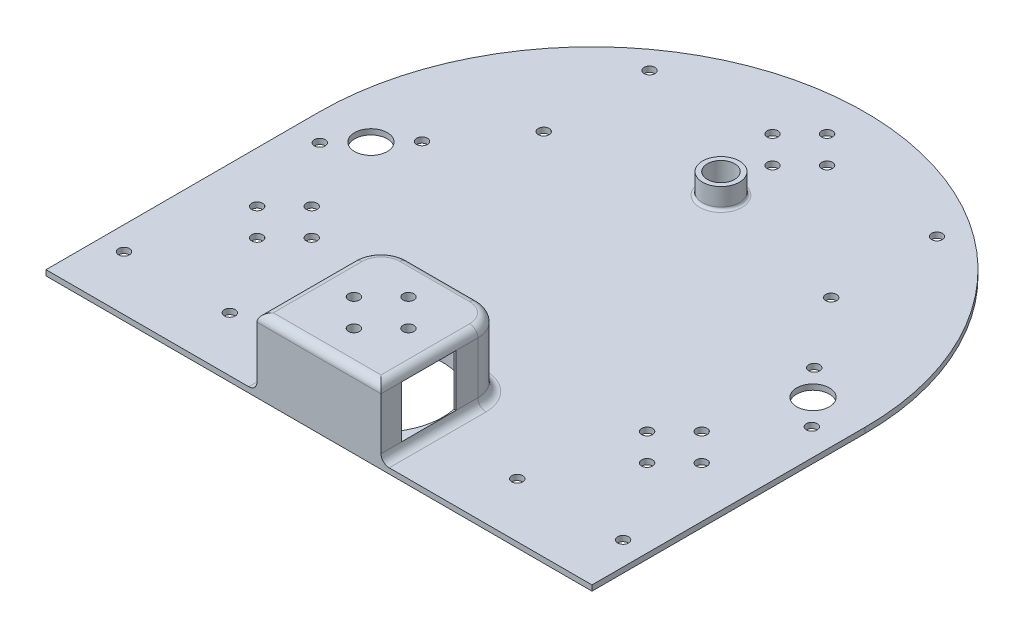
from build123d import *

# Parameters (mm, degrees)
BOSS_EXTRUDE1_DEPTH = 2
SKETCH2_R           = 2
SKETCH2_R_2         = 6
CUT_EXTRUDE1_DEPTH  = 5
SKETCH4_R           = 5
CUT_EXTRUDE2_DEPTH  = 5
SKETCH5_R           = 6.75
SKETCH5_R_2         = 5
BOSS_EXTRUDE2_DEPTH = 7.5
SKETCH8_R           = 2
CUT_EXTRUDE3_DEPTH  = 142.761313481
SKETCH9_R           = 22.5
CUT_EXTRUDE4_DEPTH  = 142.761313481
BOSS_EXTRUDE3_DEPTH = 25
CUT_EXTRUDE5_START  = -21
SKETCH11_R          = 22.5
CUT_EXTRUDE5_DEPTH  = 21
SKETCH12_R          = 2
CUT_EXTRUDE6_DEPTH  = 20
FILLET3_R           = 3
FILLET5_R           = 1
SKETCH15_R          = 2
CUT_EXTRUDE8_DEPTH  = 144.753330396
SKETCH17_W          = 20
SKETCH17_H          = 19
CUT_EXTRUDE10_DEPTH = 161.75177293


with BuildPart() as part:
    # Sketch1 → Boss-Extrude1 (new body)
    with BuildSketch(Plane(origin=(0, 0, 0), x_dir=(1, 0, 0), z_dir=(0, 1, 0))):
        with BuildLine():
            Line((-100.1, 0), (-100.1, -100.1))
            Line((-100.1, -100.1), (100.1, -100.1))
            Line((100.1, -100.1), (100.1, 0))
            ThreePointArc((100.1, 0), (0, 100.1), (-100.1, 0))
        make_face()
    extrude(amount=BOSS_EXTRUDE1_DEPTH)

    # Sketch2 → Cut-Extrude1 (cut)
    with BuildSketch(Plane(origin=(0, 2, 0), x_dir=(1, 0, 0), z_dir=(0, 1, 0))):
        with Locations(Location((-71.490397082, -31.275, 0), (0, 0, 270))):
            Circle(SKETCH2_R)
        with Locations(Location((-61.490397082, -41.275, 0), (0, 0, 270))):
            Circle(SKETCH2_R)
        with Locations(Location((-71.490397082, -51.275, 0), (0, 0, 270))):
            Circle(SKETCH2_R)
        with Locations(Location((-81.490397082, -41.275, 0), (0, 0, 270))):
            Circle(SKETCH2_R)
        with Locations(Location((61.490397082, -41.275, 0), (0, 0, 270))):
            Circle(SKETCH2_R)
        with Locations(Location((71.490397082, -31.275, 0), (0, 0, 270))):
            Circle(SKETCH2_R)
        with Locations(Location((81.490397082, -41.275, 0), (0, 0, 270))):
            Circle(SKETCH2_R)
        with Locations(Location((71.490397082, -51.275, 0), (0, 0, 270))):
            Circle(SKETCH2_R)
        with Locations(Location((0, 66.2, 0), (0, 0, 270))):
            Circle(SKETCH2_R)
        with Locations(Location((-10, 76.2, 0), (0, 0, 270))):
            Circle(SKETCH2_R)
        with Locations(Location((0, 86.2, 0), (0, 0, 270))):
            Circle(SKETCH2_R)
        with Locations(Location((10, 76.2, 0), (0, 0, 270))):
            Circle(SKETCH2_R)
        with Locations(Location((-81.05, 0, 0), (0, 0, 270))):
            Circle(SKETCH2_R_2)
        with Locations(Location((81.05, 0, 0), (0, 0, 270))):
            Circle(SKETCH2_R_2)
        with Locations(Location((0, -67.297461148, 0), (0, 0, 270))):
            Circle(SKETCH2_R)
        with Locations(Location((10, -77.297461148, 0), (0, 0, 270))):
            Circle(SKETCH2_R)
        with Locations(Location((0, -87.297461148, 0), (0, 0, 270))):
            Circle(SKETCH2_R)
        with Locations(Location((-10, -77.297461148, 0), (0, 0, 270))):
            Circle(SKETCH2_R)
    extrude(amount=-CUT_EXTRUDE1_DEPTH, mode=Mode.SUBTRACT)

    # Sketch4 → Cut-Extrude2 (cut)
    with BuildSketch(Plane(origin=(0, 2, 0), x_dir=(1, 0, 0), z_dir=(0, 1, 0))):
        with Locations(Location((0, 47.3, 0), (0, 0, 270))):
            Circle(SKETCH4_R)
    extrude(amount=-CUT_EXTRUDE2_DEPTH, mode=Mode.SUBTRACT)

    # Sketch5 → Boss-Extrude2 (add, symmetric)
    with BuildSketch(Plane(origin=(0, 2, 0), x_dir=(1, 0, 0), z_dir=(0, 1, 0))):
        with Locations(Location((0, 47.3, 0), (0, 0, 270))):
            Circle(SKETCH5_R)
        with Locations(Location((0, 47.3, 0), (0, 0, 270))):
            Circle(SKETCH5_R_2, mode=Mode.SUBTRACT)
    extrude(amount=BOSS_EXTRUDE2_DEPTH, both=True)

    # Sketch8 → Cut-Extrude3 (cut, through all)
    with BuildSketch(Plane(origin=(0, 2, 0), x_dir=(1, 0, 0), z_dir=(0, 1, 0))):
        with Locations(Location((-71.905434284, 9.588504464, 0), (0, 0, 270))):
            Circle(SKETCH8_R)
        with Locations(Location((-90.194565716, -9.588504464, 0), (0, 0, 270))):
            Circle(SKETCH8_R)
        with Locations(Location((71.905434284, 9.588504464, 0), (0, 0, 270))):
            Circle(SKETCH8_R)
        with Locations(Location((90.194565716, -9.588504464, 0), (0, 0, 270))):
            Circle(SKETCH8_R)
    extrude(amount=-CUT_EXTRUDE3_DEPTH, mode=Mode.SUBTRACT)

    # Sketch9 → Cut-Extrude4 (cut, through all)
    with BuildSketch(Plane(origin=(0, 2, 0), x_dir=(1, 0, 0), z_dir=(0, 1, 0))):
        with Locations(Location((0, -77.297461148, 0), (0, 0, 270))):
            Circle(SKETCH9_R)
    extrude(amount=-CUT_EXTRUDE4_DEPTH, mode=Mode.SUBTRACT)

    # Sketch10 → Boss-Extrude3 (add)
    with BuildSketch(Plane(origin=(0, 2, 0), x_dir=(1, 0, 0), z_dir=(0, 1, 0))):
        with BuildLine():
            Line((-22.75, -64.6), (-22.75, -100.1))
            Line((-22.75, -100.1), (22.75, -100.1))
            Line((22.75, -100.1), (22.75, -64.6))
            ThreePointArc((22.75, -64.6), (19.821067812, -57.528932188), (12.75, -54.6))
            Line((12.75, -54.6), (-12.75, -54.6))
            ThreePointArc((-12.75, -54.6), (-19.821067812, -57.528932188), (-22.75, -64.6))
        make_face()
    extrude(amount=BOSS_EXTRUDE3_DEPTH)

    # Sketch11 → Cut-Extrude5 (cut)
    with BuildSketch(Plane.XZ.offset(-2).offset(CUT_EXTRUDE5_START)):
        with Locations(Location((0, 77.297461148, 0), (0, 0, 90))):
            Circle(SKETCH11_R)
    extrude(amount=CUT_EXTRUDE5_DEPTH, mode=Mode.SUBTRACT)

    # Sketch12 → Cut-Extrude6 (cut)
    with BuildSketch(Plane.XZ.offset(-23)):
        with Locations(Location((0, 87.297461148, 0), (0, 0, 270))):
            Circle(SKETCH12_R)
        with Locations(Location((10, 77.297461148, 0), (0, 0, 270))):
            Circle(SKETCH12_R)
        with Locations(Location((0, 67.297461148, 0), (0, 0, 270))):
            Circle(SKETCH12_R)
        with Locations(Location((-10, 77.297461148, 0), (0, 0, 270))):
            Circle(SKETCH12_R)
    extrude(amount=-CUT_EXTRUDE6_DEPTH, mode=Mode.SUBTRACT)

    # Fillet3
    fillet3_edges = [part.edges().sort_by_distance(p)[0] for p in [
        (-19.821067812, 2, 57.528932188),
        (-22.75, 2, 82.35),
        (22.75, 2, 82.35),
        (19.821067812, 2, 57.528932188),
        (0, 2, 54.6),
        (-19.821067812, 27, 57.528932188),
        (-22.75, 27, 82.35),
        (0, 27, 100.1),
        (22.75, 27, 82.35),
        (19.821067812, 27, 57.528932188),
        (0, 27, 54.6),
    ]]
    fillet(fillet3_edges, radius=FILLET3_R)

    # Fillet5
    fillet5_edges = [part.edges().sort_by_distance(p)[0] for p in [
        (0, 0, -54.05),
        (0, 2, -54.05),
    ]]
    fillet(fillet5_edges, radius=FILLET5_R)

    # Sketch15 → Cut-Extrude8 (cut, through all)
    with BuildSketch(Plane(origin=(0, 2, 0), x_dir=(1, 0, 0), z_dir=(0, 1, 0))):
        with Locations(Location((-91.5, -80.1, 0), (0, 0, 270))):
            Circle(SKETCH15_R)
        with Locations(Location((-52.7, -80.1, 0), (0, 0, 270))):
            Circle(SKETCH15_R)
        with Locations(Location((52.7, -80.1, 0), (0, 0, 270))):
            Circle(SKETCH15_R)
        with Locations(Location((91.5, -80.1, 0), (0, 0, 270))):
            Circle(SKETCH15_R)
        with Locations(Location((-52.7, 73.8, 0), (0, 0, 270))):
            Circle(SKETCH15_R)
        with Locations(Location((-52.7, 35, 0), (0, 0, 270))):
            Circle(SKETCH15_R)
        with Locations(Location((52.7, 35, 0), (0, 0, 270))):
            Circle(SKETCH15_R)
        with Locations(Location((52.7, 73.8, 0), (0, 0, 270))):
            Circle(SKETCH15_R)
    extrude(amount=-CUT_EXTRUDE8_DEPTH, mode=Mode.SUBTRACT)

    # Sketch17 → Cut-Extrude10 (cut, through all)
    with BuildSketch(Plane(origin=(22.75, 0, 0), x_dir=(0, 0, -1), z_dir=(1, 0, 0))):
        with Locations((-82.6, 14.5)):
            Rectangle(SKETCH17_W, SKETCH17_H)
    extrude(amount=-CUT_EXTRUDE10_DEPTH, mode=Mode.SUBTRACT)


solid = part.part
